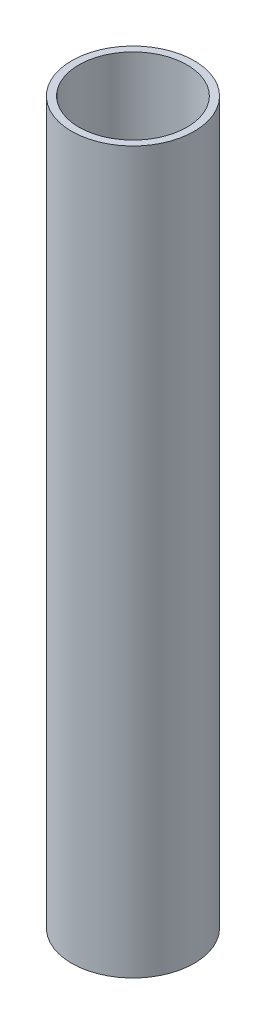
from build123d import *

# Parameters (mm, degrees)
SKETCH1_R           = 8.5
SKETCH1_R_2         = 7.5
BOSS_EXTRUDE1_DEPTH = 100


with BuildPart() as part:
    # Sketch1 → Boss-Extrude1 (new body)
    with BuildSketch(Plane(origin=(0, 0, 0), x_dir=(1, 0, 0), z_dir=(0, 1, 0))):
        with Locations(Location((0, 0, 0), (0, 0, 270))):
            Circle(SKETCH1_R)
        with Locations(Location((0, 0, 0), (0, 0, 270))):
            Circle(SKETCH1_R_2, mode=Mode.SUBTRACT)
    extrude(amount=BOSS_EXTRUDE1_DEPTH)


solid = part.part
